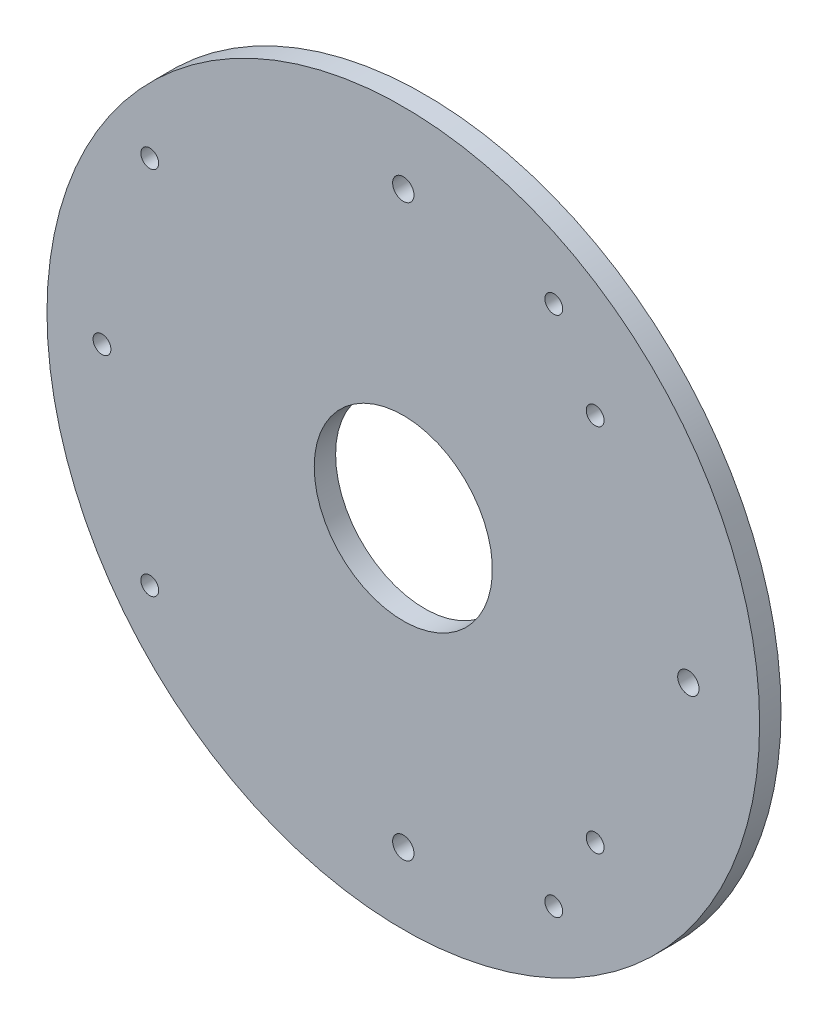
from build123d import *

# Parameters (mm, degrees)
SKETCH1_R           = 63.5
SKETCH1_R_2         = 15.875
SKETCH1_R_3         = 1.905
SKETCH1_R_4         = 1.5875
BOSS_EXTRUDE1_DEPTH = 3.81
SKETCH2_R           = 1.5875
CUT_EXTRUDE1_DEPTH  = 90.883347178


with BuildPart() as part:
    # Sketch1 → Boss-Extrude1 (new body)
    with BuildSketch(Plane.XY):
        with Locations(Location((0, 0, 0), (0, 0, 180))):
            Circle(SKETCH1_R)
        with Locations(Location((0, 0, 0), (0, 0, 180))):
            Circle(SKETCH1_R_2, mode=Mode.SUBTRACT)
        with Locations(Location((0, 50.8, 0), (0, 0, 180))):
            Circle(SKETCH1_R_3, mode=Mode.SUBTRACT)
        with Locations(Location((50.8, 0, 0), (0, 0, 180))):
            Circle(SKETCH1_R_3, mode=Mode.SUBTRACT)
        with Locations(Location((0, -50.8, 0), (0, 0, 180))):
            Circle(SKETCH1_R_3, mode=Mode.SUBTRACT)
        with Locations(Location((-45.184601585, 32.9565, 0), (0, 0, 180))):
            Circle(SKETCH1_R_4, mode=Mode.SUBTRACT)
        with Locations(Location((-45.184601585, -32.9565, 0), (0, 0, 180))):
            Circle(SKETCH1_R_4, mode=Mode.SUBTRACT)
        with Locations(Location((34.190398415, 32.9565, 0), (0, 0, 180))):
            Circle(SKETCH1_R_4, mode=Mode.SUBTRACT)
        with Locations(Location((34.190398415, -32.9565, 0), (0, 0, 180))):
            Circle(SKETCH1_R_4, mode=Mode.SUBTRACT)
    extrude(amount=BOSS_EXTRUDE1_DEPTH)

    # Sketch2 → Cut-Extrude1 (cut, through all)
    with BuildSketch(Plane.XY.offset(3.81)):
        with Locations((26.812642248, 46.482)):
            Circle(SKETCH2_R)
        with Locations((26.812642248, -46.482)):
            Circle(SKETCH2_R)
        with Locations((-53.696543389, 0)):
            Circle(SKETCH2_R)
    extrude(amount=-CUT_EXTRUDE1_DEPTH, mode=Mode.SUBTRACT)


solid = part.part
